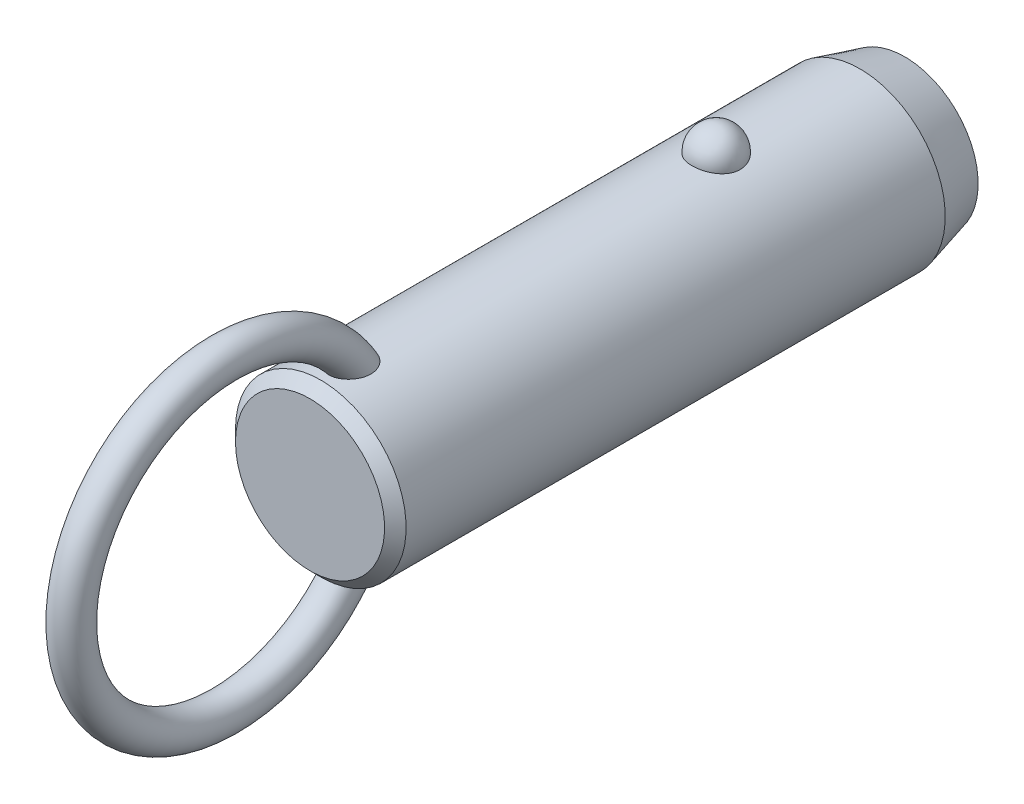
ISO-10303-21;
HEADER;
FILE_DESCRIPTION(('STEP AP214'),'2;1');
FILE_NAME('part.step','',(''),(''),'','','');
FILE_SCHEMA(('AUTOMOTIVE_DESIGN { 1 0 10303 214 1 1 1 1 }'));
ENDSEC;
DATA;
#1=APPLICATION_CONTEXT('core data for automotive mechanical design processes');
#2=APPLICATION_PROTOCOL_DEFINITION('international standard','automotive_design',2000,#1);
#3=PRODUCT_CONTEXT('',#1,'mechanical');
#4=PRODUCT('Part','Part','',(#3));
#5=PRODUCT_RELATED_PRODUCT_CATEGORY('part','',(#4));
#6=PRODUCT_DEFINITION_FORMATION('','',#4);
#7=PRODUCT_DEFINITION_CONTEXT('part definition',#1,'design');
#8=PRODUCT_DEFINITION('design','',#6,#7);
#9=PRODUCT_DEFINITION_SHAPE('','',#8);
#10=(LENGTH_UNIT() NAMED_UNIT(*) SI_UNIT(.MILLI.,.METRE.));
#11=(NAMED_UNIT(*) PLANE_ANGLE_UNIT() SI_UNIT($,.RADIAN.));
#12=(NAMED_UNIT(*) SI_UNIT($,.STERADIAN.) SOLID_ANGLE_UNIT());
#13=UNCERTAINTY_MEASURE_WITH_UNIT(LENGTH_MEASURE(1.E-05),#10,'distance_accuracy_value','');
#14=(GEOMETRIC_REPRESENTATION_CONTEXT(3) GLOBAL_UNCERTAINTY_ASSIGNED_CONTEXT((#13)) GLOBAL_UNIT_ASSIGNED_CONTEXT((#10,
#11,#12)) REPRESENTATION_CONTEXT('',''));
#15=CARTESIAN_POINT('',(0.,0.,0.));
#16=DIRECTION('',(0.,0.,1.));
#17=DIRECTION('',(1.,0.,0.));
#18=AXIS2_PLACEMENT_3D('',#15,#16,#17);
#19=CARTESIAN_POINT('',(0.,0.,33.));
#20=DIRECTION('',(0.,0.,-1.));
#21=DIRECTION('',(-1.,0.,0.));
#22=AXIS2_PLACEMENT_3D('',#19,#20,#21);
#23=CYLINDRICAL_SURFACE('',#22,9.5);
#24=CARTESIAN_POINT('',(2.67259918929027,9.11631578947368,-2.7));
#25=CARTESIAN_POINT('',(2.6725968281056,9.11631786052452,-2.54909854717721));
#26=CARTESIAN_POINT('',(2.66030567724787,9.11994722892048,-2.39816735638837));
#27=CARTESIAN_POINT('',(2.6114347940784,9.13405924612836,-2.10058568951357));
#28=CARTESIAN_POINT('',(2.57484658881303,9.14454428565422,-1.95393672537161));
#29=CARTESIAN_POINT('',(2.47830875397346,9.17117631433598,-1.66916069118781));
#30=CARTESIAN_POINT('',(2.41836936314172,9.18732082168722,-1.53102991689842));
#31=CARTESIAN_POINT('',(2.27661331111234,9.22346780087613,-1.26705393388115));
#32=CARTESIAN_POINT('',(2.19479699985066,9.24347021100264,-1.14120852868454));
#33=CARTESIAN_POINT('',(2.01085282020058,9.28522401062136,-0.904632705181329));
#34=CARTESIAN_POINT('',(1.90862396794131,9.30698376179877,-0.793982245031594));
#35=CARTESIAN_POINT('',(1.6867437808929,9.34973971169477,-0.591607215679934));
#36=CARTESIAN_POINT('',(1.56709244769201,9.37073591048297,-0.499882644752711));
#37=CARTESIAN_POINT('',(1.31393976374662,9.40956370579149,-0.338167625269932));
#38=CARTESIAN_POINT('',(1.18048026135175,9.42740444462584,-0.268113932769));
#39=CARTESIAN_POINT('',(0.903154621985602,9.45799906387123,-0.151390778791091));
#40=CARTESIAN_POINT('',(0.759289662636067,9.47075351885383,-0.104718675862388));
#41=CARTESIAN_POINT('',(0.468074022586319,9.48956256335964,-0.0367633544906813));
#42=CARTESIAN_POINT('',(0.320836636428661,9.49573643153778,-0.0150275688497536));
#43=CARTESIAN_POINT('',(0.0246714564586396,9.50112183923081,0.00396199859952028));
#44=CARTESIAN_POINT('',(-0.124256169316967,9.50033406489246,0.00121819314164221));
#45=CARTESIAN_POINT('',(-0.417264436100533,9.4919475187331,-0.028444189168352));
#46=CARTESIAN_POINT('',(-0.561384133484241,9.48444885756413,-0.0550074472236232));
#47=CARTESIAN_POINT('',(-0.842986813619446,9.46357853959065,-0.131064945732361));
#48=CARTESIAN_POINT('',(-0.98046968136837,9.450206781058,-0.180559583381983));
#49=CARTESIAN_POINT('',(-1.24585005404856,9.41890822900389,-0.301476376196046));
#50=CARTESIAN_POINT('',(-1.37368611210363,9.40095498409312,-0.373026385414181));
#51=CARTESIAN_POINT('',(-1.61552738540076,9.3624296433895,-0.536025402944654));
#52=CARTESIAN_POINT('',(-1.72953116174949,9.34185727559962,-0.627476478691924));
#53=CARTESIAN_POINT('',(-1.9429225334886,9.29984568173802,-0.829844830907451));
#54=CARTESIAN_POINT('',(-2.04198021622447,9.27839736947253,-0.941108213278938));
#55=CARTESIAN_POINT('',(-2.2202646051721,9.23735994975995,-1.17883414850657));
#56=CARTESIAN_POINT('',(-2.29948985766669,9.21777097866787,-1.30529781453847));
#57=CARTESIAN_POINT('',(-2.43697287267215,9.18238994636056,-1.57158566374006));
#58=CARTESIAN_POINT('',(-2.49497068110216,9.16664569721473,-1.71155057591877));
#59=CARTESIAN_POINT('',(-2.5872073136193,9.14104303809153,-1.99961197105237));
#60=CARTESIAN_POINT('',(-2.62144683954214,9.13118445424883,-2.14770821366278));
#61=CARTESIAN_POINT('',(-2.66521466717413,9.11850622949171,-2.44715424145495));
#62=CARTESIAN_POINT('',(-2.67484831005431,9.11565658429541,-2.59848735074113));
#63=CARTESIAN_POINT('',(-2.66946735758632,9.11723375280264,-2.90067317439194));
#64=CARTESIAN_POINT('',(-2.65445345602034,9.12166036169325,-3.05152590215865));
#65=CARTESIAN_POINT('',(-2.6002971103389,9.13724422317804,-3.34766110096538));
#66=CARTESIAN_POINT('',(-2.56127978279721,9.14836656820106,-3.49296833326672));
#67=CARTESIAN_POINT('',(-2.46018844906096,9.17606676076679,-3.77477535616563));
#68=CARTESIAN_POINT('',(-2.39811349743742,9.19264483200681,-3.9112747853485));
#69=CARTESIAN_POINT('',(-2.25202303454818,9.22952198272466,-4.17244273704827));
#70=CARTESIAN_POINT('',(-2.16788714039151,9.24984129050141,-4.29704106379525));
#71=CARTESIAN_POINT('',(-1.9799408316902,9.29188255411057,-4.53013066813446));
#72=CARTESIAN_POINT('',(-1.87612963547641,9.31360456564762,-4.63862130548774));
#73=CARTESIAN_POINT('',(-1.65105429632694,9.35612959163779,-4.8369029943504));
#74=CARTESIAN_POINT('',(-1.52972405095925,9.37692871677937,-4.92661991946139));
#75=CARTESIAN_POINT('',(-1.27318250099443,9.41518970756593,-5.08429106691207));
#76=CARTESIAN_POINT('',(-1.13797219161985,9.432651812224,-5.15224684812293));
#77=CARTESIAN_POINT('',(-0.859280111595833,9.46208255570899,-5.26371827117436));
#78=CARTESIAN_POINT('',(-0.715925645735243,9.47411833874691,-5.30753421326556));
#79=CARTESIAN_POINT('',(-0.423550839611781,9.4916822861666,-5.37076321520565));
#80=CARTESIAN_POINT('',(-0.274531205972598,9.49721125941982,-5.39017930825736));
#81=CARTESIAN_POINT('',(0.0218446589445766,9.50110860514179,-5.40390587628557));
#82=CARTESIAN_POINT('',(0.169177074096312,9.49961381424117,-5.39869609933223));
#83=CARTESIAN_POINT('',(0.460808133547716,9.48993906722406,-5.3644195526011));
#84=CARTESIAN_POINT('',(0.605106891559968,9.48175936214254,-5.33535367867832));
#85=CARTESIAN_POINT('',(0.886027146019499,9.4596376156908,-5.2543558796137));
#86=CARTESIAN_POINT('',(1.02267710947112,9.44571881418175,-5.20251612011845));
#87=CARTESIAN_POINT('',(1.28523827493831,9.41358993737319,-5.07741549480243));
#88=CARTESIAN_POINT('',(1.41114877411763,9.39537958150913,-5.00415322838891));
#89=CARTESIAN_POINT('',(1.65085227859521,9.3562644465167,-4.83684599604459));
#90=CARTESIAN_POINT('',(1.76442346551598,9.33532178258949,-4.74249218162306));
#91=CARTESIAN_POINT('',(1.97425672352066,9.29321198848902,-4.53620389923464));
#92=CARTESIAN_POINT('',(2.07051582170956,9.27204482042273,-4.42426641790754));
#93=CARTESIAN_POINT('',(2.24490086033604,9.23139221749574,-4.18363183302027));
#94=CARTESIAN_POINT('',(2.32267019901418,9.21194380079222,-4.05466990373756));
#95=CARTESIAN_POINT('',(2.45584092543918,9.1773419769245,-3.78517836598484));
#96=CARTESIAN_POINT('',(2.51124979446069,9.16218713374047,-3.64465264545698));
#97=CARTESIAN_POINT('',(2.59380876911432,9.13913522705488,-3.37104301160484));
#98=CARTESIAN_POINT('',(2.62330266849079,9.13064624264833,-3.23871053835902));
#99=CARTESIAN_POINT('',(2.66269870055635,9.11923566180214,-2.97092664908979));
#100=CARTESIAN_POINT('',(2.67260130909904,9.11631393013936,-2.83547530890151));
#101=CARTESIAN_POINT('',(2.67259918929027,9.11631578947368,-2.7));
#102=B_SPLINE_CURVE_WITH_KNOTS('',3,(#24,#25,#26,#27,#28,#29,#30,#31,#32,#33,#34,#35,#36,#37,
#38,#39,#40,#41,#42,#43,#44,#45,#46,#47,#48,#49,#50,#51,#52,#53,#54,#55,#56,#57,#58,#59,#60,#61,
#62,#63,#64,#65,#66,#67,#68,#69,#70,#71,#72,#73,#74,#75,#76,#77,#78,#79,#80,#81,#82,#83,#84,#85,
#86,#87,#88,#89,#90,#91,#92,#93,#94,#95,#96,#97,#98,#99,#100,#101),.UNSPECIFIED.,.T.,.F.,(4,2,2,
2,2,2,2,2,2,2,2,2,2,2,2,2,2,2,2,2,2,2,2,2,2,2,2,2,2,2,2,2,2,2,2,2,2,2,4),(0.,0.452217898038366,
0.904593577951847,1.35677112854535,1.80894144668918,2.26340676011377,2.71787203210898,
3.17099820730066,3.62407318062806,4.0687883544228,4.51345969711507,4.95160616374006,
5.38976021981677,5.83050358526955,6.27129275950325,6.72071308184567,7.17016633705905,
7.62495278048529,8.07972578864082,8.53254856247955,8.98535859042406,9.43582813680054,
9.88631615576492,10.3393155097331,10.7923328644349,11.2471065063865,11.7018475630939,
12.1507959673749,12.5996885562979,13.0398725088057,13.4800399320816,13.9184421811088,
14.3568730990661,14.802202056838,15.2476074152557,15.7010097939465,16.1542603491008,
16.5602594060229,16.9662486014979),.UNSPECIFIED.);
#103=CARTESIAN_POINT('',(2.67259918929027,9.11631578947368,-2.7));
#104=VERTEX_POINT('',#103);
#105=EDGE_CURVE('E41',#104,#104,#102,.T.);
#106=ORIENTED_EDGE('',*,*,#105,.T.);
#107=EDGE_LOOP('',(#106));
#108=FACE_BOUND('',#107,.T.);
#109=CARTESIAN_POINT('',(0.,0.,41.32));
#110=DIRECTION('',(0.,0.,1.));
#111=DIRECTION('',(1.,0.,0.));
#112=AXIS2_PLACEMENT_3D('',#109,#110,#111);
#113=CIRCLE('',#112,9.5);
#114=CARTESIAN_POINT('',(-9.5,0.,41.32));
#115=VERTEX_POINT('',#114);
#116=EDGE_CURVE('E10',#115,#115,#113,.F.);
#117=ORIENTED_EDGE('',*,*,#116,.T.);
#118=EDGE_LOOP('',(#117));
#119=FACE_BOUND('',#118,.T.);
#120=CARTESIAN_POINT('',(-0.697062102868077,-9.47439269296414,35.6678088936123));
#121=CARTESIAN_POINT('',(-0.799579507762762,-9.46685146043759,35.7074823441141));
#122=CARTESIAN_POINT('',(-0.898575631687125,-9.45788043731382,35.7559309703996));
#123=CARTESIAN_POINT('',(-1.08670047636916,-9.43811593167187,35.8688685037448));
#124=CARTESIAN_POINT('',(-1.17583204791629,-9.42732297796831,35.9333527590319));
#125=CARTESIAN_POINT('',(-1.34179806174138,-9.40513672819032,36.0762099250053));
#126=CARTESIAN_POINT('',(-1.41865133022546,-9.39374438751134,36.154561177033));
#127=CARTESIAN_POINT('',(-1.5586004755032,-9.37154196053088,36.3227524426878));
#128=CARTESIAN_POINT('',(-1.62169476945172,-9.3607319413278,36.4125937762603));
#129=CARTESIAN_POINT('',(-1.73527695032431,-9.34035749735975,36.6045001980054));
#130=CARTESIAN_POINT('',(-1.7852226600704,-9.33085270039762,36.7068910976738));
#131=CARTESIAN_POINT('',(-1.86924997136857,-9.3143834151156,36.918148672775));
#132=CARTESIAN_POINT('',(-1.90332570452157,-9.30741986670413,37.0270177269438));
#133=CARTESIAN_POINT('',(-1.95893603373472,-9.29588482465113,37.2604730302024));
#134=CARTESIAN_POINT('',(-1.97872420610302,-9.29165182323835,37.3854890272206));
#135=CARTESIAN_POINT('',(-2.00062129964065,-9.28695978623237,37.6370805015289));
#136=CARTESIAN_POINT('',(-2.00272284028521,-9.28650232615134,37.763656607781));
#137=CARTESIAN_POINT('',(-1.98958876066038,-9.28932750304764,38.0368157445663));
#138=CARTESIAN_POINT('',(-1.97143366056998,-9.2932400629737,38.1832519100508));
#139=CARTESIAN_POINT('',(-1.91479925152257,-9.30507151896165,38.4720629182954));
#140=CARTESIAN_POINT('',(-1.87629122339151,-9.31299607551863,38.614431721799));
#141=CARTESIAN_POINT('',(-1.77225683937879,-9.33340232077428,38.9151725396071));
#142=CARTESIAN_POINT('',(-1.70334898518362,-9.34641636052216,39.0723691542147));
#143=CARTESIAN_POINT('',(-1.58111062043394,-9.36759153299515,39.2975171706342));
#144=CARTESIAN_POINT('',(-1.53721459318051,-9.37492619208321,39.3707968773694));
#145=CARTESIAN_POINT('',(-1.44302631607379,-9.38988566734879,39.5130740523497));
#146=CARTESIAN_POINT('',(-1.39273721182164,-9.39751033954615,39.5820736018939));
#147=CARTESIAN_POINT('',(-1.26775962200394,-9.41530678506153,39.7369832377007));
#148=CARTESIAN_POINT('',(-1.19052326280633,-9.42548108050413,39.8208712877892));
#149=CARTESIAN_POINT('',(-1.02420241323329,-9.44499825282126,39.9760086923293));
#150=CARTESIAN_POINT('',(-0.935139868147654,-9.45434261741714,40.0472808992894));
#151=CARTESIAN_POINT('',(-0.766610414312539,-9.46930670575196,40.1586955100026));
#152=CARTESIAN_POINT('',(-0.689439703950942,-9.47529223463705,40.2022354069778));
#153=CARTESIAN_POINT('',(-0.528942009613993,-9.48560294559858,40.2763133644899));
#154=CARTESIAN_POINT('',(-0.44562029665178,-9.48992953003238,40.3068624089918));
#155=CARTESIAN_POINT('',(-0.273901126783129,-9.49644161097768,40.3525792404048));
#156=CARTESIAN_POINT('',(-0.185465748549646,-9.49860811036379,40.36761059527));
#157=CARTESIAN_POINT('',(-0.00734541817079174,-9.5004135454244,40.3801494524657));
#158=CARTESIAN_POINT('',(0.0823387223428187,-9.50005405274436,40.3776678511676));
#159=CARTESIAN_POINT('',(0.247679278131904,-9.49708301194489,40.3569959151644));
#160=CARTESIAN_POINT('',(0.323620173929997,-9.49477609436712,40.3409300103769));
#161=CARTESIAN_POINT('',(0.471981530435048,-9.48855917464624,40.2971726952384));
#162=CARTESIAN_POINT('',(0.54440029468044,-9.48464840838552,40.2694757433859));
#163=CARTESIAN_POINT('',(0.708947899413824,-9.47398336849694,40.1928026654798));
#164=CARTESIAN_POINT('',(0.799149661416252,-9.46671310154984,40.1397745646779));
#165=CARTESIAN_POINT('',(0.969783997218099,-9.4507622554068,40.0199731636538));
#166=CARTESIAN_POINT('',(1.05019415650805,-9.44207854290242,39.9531692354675));
#167=CARTESIAN_POINT('',(1.23092343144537,-9.42051459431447,39.7807596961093));
#168=CARTESIAN_POINT('',(1.32652499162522,-9.40733378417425,39.6702619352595));
#169=CARTESIAN_POINT('',(1.49893121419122,-9.38140745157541,39.4355614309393));
#170=CARTESIAN_POINT('',(1.57571616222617,-9.36866239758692,39.3113445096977));
#171=CARTESIAN_POINT('',(1.71285426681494,-9.34457644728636,39.0493891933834));
#172=CARTESIAN_POINT('',(1.77266365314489,-9.33328726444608,38.9113623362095));
#173=CARTESIAN_POINT('',(1.87239208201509,-9.31379209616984,38.6280515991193));
#174=CARTESIAN_POINT('',(1.91230158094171,-9.3055875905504,38.482764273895));
#175=CARTESIAN_POINT('',(1.9760418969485,-9.29228394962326,38.1620281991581));
#176=CARTESIAN_POINT('',(1.99587438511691,-9.28797202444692,37.9857248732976));
#177=CARTESIAN_POINT('',(2.0029570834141,-9.28645519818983,37.6324146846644));
#178=CARTESIAN_POINT('',(1.99025930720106,-9.28923895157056,37.4554093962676));
#179=CARTESIAN_POINT('',(1.93735479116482,-9.30038134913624,37.1563381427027));
#180=CARTESIAN_POINT('',(1.90576827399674,-9.30697680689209,37.0326679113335));
#181=CARTESIAN_POINT('',(1.82287484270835,-9.32356855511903,36.7923297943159));
#182=CARTESIAN_POINT('',(1.77158213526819,-9.33356239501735,36.6756569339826));
#183=CARTESIAN_POINT('',(1.64885744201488,-9.35602275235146,36.4527061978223));
#184=CARTESIAN_POINT('',(1.57730995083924,-9.36850332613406,36.3464927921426));
#185=CARTESIAN_POINT('',(1.41543264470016,-9.39431873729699,36.1495530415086));
#186=CARTESIAN_POINT('',(1.32510883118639,-9.40765330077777,36.0588217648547));
#187=CARTESIAN_POINT('',(1.13846223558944,-9.43195720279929,35.9050334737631));
#188=CARTESIAN_POINT('',(1.04369890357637,-9.44302894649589,35.8400947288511));
#189=CARTESIAN_POINT('',(0.843965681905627,-9.46296805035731,35.7280388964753));
#190=CARTESIAN_POINT('',(0.739000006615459,-9.4718363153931,35.6809144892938));
#191=CARTESIAN_POINT('',(0.528175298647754,-9.48586140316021,35.6081173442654));
#192=CARTESIAN_POINT('',(0.422686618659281,-9.49119633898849,35.5814024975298));
#193=CARTESIAN_POINT('',(0.208590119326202,-9.49831365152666,35.5460137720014));
#194=CARTESIAN_POINT('',(0.0999817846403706,-9.500095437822,35.5373428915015));
#195=CARTESIAN_POINT('',(-0.126104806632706,-9.49988861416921,35.5383501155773));
#196=CARTESIAN_POINT('',(-0.243578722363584,-9.49757821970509,35.5495942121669));
#197=CARTESIAN_POINT('',(-0.474390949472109,-9.48885165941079,35.593167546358));
#198=CARTESIAN_POINT('',(-0.587729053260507,-9.48243528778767,35.6254978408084));
#199=CARTESIAN_POINT('',(-0.697062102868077,-9.47439269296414,35.6678088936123));
#200=B_SPLINE_CURVE_WITH_KNOTS('',3,(#120,#121,#122,#123,#124,#125,#126,#127,#128,#129,#130,
#131,#132,#133,#134,#135,#136,#137,#138,#139,#140,#141,#142,#143,#144,#145,#146,#147,#148,#149,
#150,#151,#152,#153,#154,#155,#156,#157,#158,#159,#160,#161,#162,#163,#164,#165,#166,#167,#168,
#169,#170,#171,#172,#173,#174,#175,#176,#177,#178,#179,#180,#181,#182,#183,#184,#185,#186,#187,
#188,#189,#190,#191,#192,#193,#194,#195,#196,#197,#198,#199),.UNSPECIFIED.,.T.,.F.,(4,2,2,2,2,2,
2,2,2,2,2,2,2,2,2,2,2,2,2,2,2,2,2,2,2,2,2,2,2,2,2,2,2,2,2,2,2,2,2,4),(0.,0.330119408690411,
0.660143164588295,0.989655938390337,1.31920659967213,1.66074728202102,2.00241415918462,
2.38088696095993,2.75951768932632,3.20065679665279,3.6424200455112,4.15620996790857,
4.41314162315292,4.66994734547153,5.01228664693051,5.35399933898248,5.61943037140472,
5.88463652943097,6.15215502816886,6.41950709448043,6.65144391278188,6.88349136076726,
7.19641200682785,7.51003602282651,7.94779711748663,8.38601491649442,8.83699707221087,
9.28819530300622,9.81778662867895,10.3465317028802,10.7284172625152,11.1100280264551,
11.4938603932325,11.8775702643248,12.2220189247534,12.5663259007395,12.8915939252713,
13.2169159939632,13.5689650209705,13.9210316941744),.UNSPECIFIED.);
#201=CARTESIAN_POINT('',(-0.697062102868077,-9.47439269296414,35.6678088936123));
#202=VERTEX_POINT('',#201);
#203=EDGE_CURVE('E59',#202,#202,#200,.T.);
#204=ORIENTED_EDGE('',*,*,#203,.T.);
#205=EDGE_LOOP('',(#204));
#206=FACE_BOUND('',#205,.T.);
#207=CARTESIAN_POINT('',(-0.697062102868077,9.47439269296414,35.6678088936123));
#208=CARTESIAN_POINT('',(-0.597792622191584,9.48169483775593,35.6293956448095));
#209=CARTESIAN_POINT('',(-0.495106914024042,9.48766580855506,35.5991682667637));
#210=CARTESIAN_POINT('',(-0.285876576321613,9.49627648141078,35.5560327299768));
#211=CARTESIAN_POINT('',(-0.179324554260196,9.49890941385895,35.5431597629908));
#212=CARTESIAN_POINT('',(0.0344157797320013,9.50053798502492,35.5351666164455));
#213=CARTESIAN_POINT('',(0.141603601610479,9.49953613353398,35.5400341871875));
#214=CARTESIAN_POINT('',(0.353563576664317,9.49401038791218,35.5673654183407));
#215=CARTESIAN_POINT('',(0.458336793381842,9.48948807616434,35.58982117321));
#216=CARTESIAN_POINT('',(0.66249373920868,9.4774236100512,35.6516719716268));
#217=CARTESIAN_POINT('',(0.761881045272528,9.46988348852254,35.6910556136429));
#218=CARTESIAN_POINT('',(0.952608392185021,9.45260382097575,35.7856342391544));
#219=CARTESIAN_POINT('',(1.04394806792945,9.44286417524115,35.8408299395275));
#220=CARTESIAN_POINT('',(1.21712767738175,9.4221176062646,35.9660662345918));
#221=CARTESIAN_POINT('',(1.29885671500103,9.41109835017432,36.0362579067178));
#222=CARTESIAN_POINT('',(1.4497897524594,9.38903310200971,36.188980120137));
#223=CARTESIAN_POINT('',(1.51899278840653,9.37798710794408,36.2715116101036));
#224=CARTESIAN_POINT('',(1.64602857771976,9.35654375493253,36.4497763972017));
#225=CARTESIAN_POINT('',(1.70333052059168,9.34618688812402,36.5458916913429));
#226=CARTESIAN_POINT('',(1.80259341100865,9.32755128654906,36.745897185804));
#227=CARTESIAN_POINT('',(1.84454942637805,9.31927322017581,36.8497898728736));
#228=CARTESIAN_POINT('',(1.91637039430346,9.30478365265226,37.072213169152));
#229=CARTESIAN_POINT('',(1.944805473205,9.29882552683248,37.1912192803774));
#230=CARTESIAN_POINT('',(1.98449865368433,9.29043398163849,37.4321436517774));
#231=CARTESIAN_POINT('',(1.99574908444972,9.28800213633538,37.5540631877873));
#232=CARTESIAN_POINT('',(2.00275141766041,9.28649645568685,37.8169324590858));
#233=CARTESIAN_POINT('',(1.99588238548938,9.28799035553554,37.9579529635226));
#234=CARTESIAN_POINT('',(1.96270559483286,9.29505517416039,38.2376217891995));
#235=CARTESIAN_POINT('',(1.93637872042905,9.30063010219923,38.376267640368));
#236=CARTESIAN_POINT('',(1.85949176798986,9.31633564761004,38.6725616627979));
#237=CARTESIAN_POINT('',(1.80549792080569,9.3270926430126,38.8292907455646));
#238=CARTESIAN_POINT('',(1.67376869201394,9.3516306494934,39.1322840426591));
#239=CARTESIAN_POINT('',(1.59603181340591,9.36541185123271,39.2785475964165));
#240=CARTESIAN_POINT('',(1.4360277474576,9.39110706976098,39.5258138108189));
#241=CARTESIAN_POINT('',(1.35831795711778,9.40278656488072,39.629791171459));
#242=CARTESIAN_POINT('',(1.18774483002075,9.42585025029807,39.8245347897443));
#243=CARTESIAN_POINT('',(1.09490932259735,9.43723493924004,39.9153247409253));
#244=CARTESIAN_POINT('',(0.921110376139,9.45552616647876,40.0562033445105));
#245=CARTESIAN_POINT('',(0.843738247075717,9.46281058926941,40.1106563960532));
#246=CARTESIAN_POINT('',(0.681245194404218,9.47589120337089,40.2067117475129));
#247=CARTESIAN_POINT('',(0.596135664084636,9.48168953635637,40.2483325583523));
#248=CARTESIAN_POINT('',(0.433779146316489,9.49038144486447,40.3100899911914));
#249=CARTESIAN_POINT('',(0.357459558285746,9.49359170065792,40.3326013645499));
#250=CARTESIAN_POINT('',(0.20207411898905,9.49816761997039,40.3645745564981));
#251=CARTESIAN_POINT('',(0.12301025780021,9.49953459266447,40.3740456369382));
#252=CARTESIAN_POINT('',(-0.0357372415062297,9.50026497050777,40.3791143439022));
#253=CARTESIAN_POINT('',(-0.115421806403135,9.49962433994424,40.3746840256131));
#254=CARTESIAN_POINT('',(-0.272823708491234,9.49640854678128,40.3522962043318));
#255=CARTESIAN_POINT('',(-0.350540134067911,9.4938325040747,40.3343325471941));
#256=CARTESIAN_POINT('',(-0.500580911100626,9.4870946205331,40.2868028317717));
#257=CARTESIAN_POINT('',(-0.572979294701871,9.48296359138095,40.2574618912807));
#258=CARTESIAN_POINT('',(-0.712864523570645,9.47347609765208,40.1890087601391));
#259=CARTESIAN_POINT('',(-0.7803490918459,9.46811906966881,40.1498920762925));
#260=CARTESIAN_POINT('',(-0.946309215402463,9.45329720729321,40.039432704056));
#261=CARTESIAN_POINT('',(-1.04090230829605,9.44321512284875,39.9623297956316));
#262=CARTESIAN_POINT('',(-1.21661929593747,9.42219227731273,39.7940971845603));
#263=CARTESIAN_POINT('',(-1.29770519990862,9.41124921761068,39.7029292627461));
#264=CARTESIAN_POINT('',(-1.4731964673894,9.38563439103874,39.4761621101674));
#265=CARTESIAN_POINT('',(-1.56208878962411,9.37102009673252,39.3362895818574));
#266=CARTESIAN_POINT('',(-1.71623987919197,9.34401559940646,39.0439503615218));
#267=CARTESIAN_POINT('',(-1.7814786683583,9.33162728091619,38.8914731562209));
#268=CARTESIAN_POINT('',(-1.88853837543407,9.31055541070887,38.5756470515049));
#269=CARTESIAN_POINT('',(-1.9299899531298,9.30193076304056,38.4121685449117));
#270=CARTESIAN_POINT('',(-1.98590726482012,9.29015757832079,38.0805268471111));
#271=CARTESIAN_POINT('',(-2.00040705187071,9.2870021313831,37.9123698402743));
#272=CARTESIAN_POINT('',(-1.99964701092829,9.28716218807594,37.6050806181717));
#273=CARTESIAN_POINT('',(-1.98908145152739,9.28945704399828,37.4659362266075));
#274=CARTESIAN_POINT('',(-1.94566294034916,9.29865169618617,37.1911539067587));
#275=CARTESIAN_POINT('',(-1.91282062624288,9.30554929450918,37.055514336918));
#276=CARTESIAN_POINT('',(-1.84582133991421,9.31898248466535,36.8578026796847));
#277=CARTESIAN_POINT('',(-1.82038084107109,9.32400364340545,36.7925830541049));
#278=CARTESIAN_POINT('',(-1.76350511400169,9.33492884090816,36.6649033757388));
#279=CARTESIAN_POINT('',(-1.73207305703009,9.3408324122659,36.6024418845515));
#280=CARTESIAN_POINT('',(-1.66324243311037,9.353333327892,36.4809407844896));
#281=CARTESIAN_POINT('',(-1.62584239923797,9.35993084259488,36.4219020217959));
#282=CARTESIAN_POINT('',(-1.545276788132,9.37356864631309,36.3079875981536));
#283=CARTESIAN_POINT('',(-1.50211241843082,9.38060884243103,36.2531110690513));
#284=CARTESIAN_POINT('',(-1.37681147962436,9.40004442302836,36.1099619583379));
#285=CARTESIAN_POINT('',(-1.28916358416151,9.41261047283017,36.0264295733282));
#286=CARTESIAN_POINT('',(-1.09996826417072,9.43658180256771,35.8772360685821));
#287=CARTESIAN_POINT('',(-0.998461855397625,9.44799034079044,35.8115238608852));
#288=CARTESIAN_POINT('',(-0.860188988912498,9.46103017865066,35.7394367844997));
#289=CARTESIAN_POINT('',(-0.82814120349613,9.46389141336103,35.7238511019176));
#290=CARTESIAN_POINT('',(-0.763210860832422,9.46934915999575,35.6944734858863));
#291=CARTESIAN_POINT('',(-0.730328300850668,9.47194567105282,35.6806815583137));
#292=CARTESIAN_POINT('',(-0.697062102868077,9.47439269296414,35.6678088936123));
#293=B_SPLINE_CURVE_WITH_KNOTS('',3,(#207,#208,#209,#210,#211,#212,#213,#214,#215,#216,#217,
#218,#219,#220,#221,#222,#223,#224,#225,#226,#227,#228,#229,#230,#231,#232,#233,#234,#235,#236,
#237,#238,#239,#240,#241,#242,#243,#244,#245,#246,#247,#248,#249,#250,#251,#252,#253,#254,#255,
#256,#257,#258,#259,#260,#261,#262,#263,#264,#265,#266,#267,#268,#269,#270,#271,#272,#273,#274,
#275,#276,#277,#278,#279,#280,#281,#282,#283,#284,#285,#286,#287,#288,#289,#290,#291,#292),
.UNSPECIFIED.,.T.,.F.,(4,2,2,2,2,2,2,2,2,2,2,2,2,2,2,2,2,2,2,2,2,2,2,2,2,2,2,2,2,2,2,2,2,2,2,2,
2,2,2,2,2,2,4),(0.,0.319942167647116,0.640532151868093,0.96090081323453,1.28112555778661,
1.60113495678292,1.92115886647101,2.24457323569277,2.56801248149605,2.90371927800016,
3.23953387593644,3.60560313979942,3.97183576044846,4.39383693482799,4.81625324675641,
5.31257045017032,5.80891895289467,6.19868344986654,6.58773876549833,6.87145417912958,
7.15475838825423,7.3926375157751,7.63034760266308,7.86853584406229,8.10683246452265,
8.3406366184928,8.57454843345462,8.93983939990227,9.30614105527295,9.80266668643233,
10.2996107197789,10.8040753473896,11.3079021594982,11.7249776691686,12.1418541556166,
12.3521485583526,12.562331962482,12.7725671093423,12.9827582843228,13.3458276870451,
13.7078449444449,13.8150604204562,13.9222762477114),.UNSPECIFIED.);
#294=CARTESIAN_POINT('',(-0.697062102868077,9.47439269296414,35.6678088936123));
#295=VERTEX_POINT('',#294);
#296=EDGE_CURVE('E67',#295,#295,#293,.T.);
#297=ORIENTED_EDGE('',*,*,#296,.T.);
#298=EDGE_LOOP('',(#297));
#299=FACE_BOUND('',#298,.T.);
#300=CARTESIAN_POINT('',(0.,0.,-18.6999999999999));
#301=DIRECTION('',(0.,0.,-1.));
#302=DIRECTION('',(-1.,0.,0.));
#303=AXIS2_PLACEMENT_3D('',#300,#301,#302);
#304=CIRCLE('',#303,9.5);
#305=CARTESIAN_POINT('',(-9.5,0.,-18.6999999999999));
#306=VERTEX_POINT('',#305);
#307=EDGE_CURVE('E56',#306,#306,#304,.F.);
#308=ORIENTED_EDGE('',*,*,#307,.T.);
#309=EDGE_LOOP('',(#308));
#310=FACE_BOUND('',#309,.T.);
#311=ADVANCED_FACE('F37',(#108,#119,#206,#299,#310),#23,.T.);
#312=CARTESIAN_POINT('',(0.,0.,-23.7));
#313=DIRECTION('',(0.,0.,-1.));
#314=DIRECTION('',(-1.,0.,0.));
#315=AXIS2_PLACEMENT_3D('',#312,#313,#314);
#316=PLANE('',#315);
#317=CARTESIAN_POINT('',(0.,0.,-23.7));
#318=DIRECTION('',(0.,0.,-1.));
#319=DIRECTION('',(-1.,0.,0.));
#320=AXIS2_PLACEMENT_3D('',#317,#318,#319);
#321=CIRCLE('',#320,8.16025403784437);
#322=CARTESIAN_POINT('',(-8.16025403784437,0.,-23.7));
#323=VERTEX_POINT('',#322);
#324=EDGE_CURVE('E66',#323,#323,#321,.T.);
#325=ORIENTED_EDGE('',*,*,#324,.T.);
#326=EDGE_LOOP('',(#325));
#327=FACE_BOUND('',#326,.T.);
#328=ADVANCED_FACE('F85',(#327),#316,.T.);
#329=CARTESIAN_POINT('',(0.,0.,-23.7));
#330=DIRECTION('',(0.,0.,1.));
#331=DIRECTION('',(1.,0.,0.));
#332=AXIS2_PLACEMENT_3D('',#329,#330,#331);
#333=CONICAL_SURFACE('',#332,8.16025403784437,0.261799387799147);
#334=ORIENTED_EDGE('',*,*,#307,.F.);
#335=EDGE_LOOP('',(#334));
#336=FACE_BOUND('',#335,.T.);
#337=ORIENTED_EDGE('',*,*,#324,.F.);
#338=EDGE_LOOP('',(#337));
#339=FACE_BOUND('',#338,.T.);
#340=ADVANCED_FACE('F83',(#336,#339),#333,.T.);
#341=CARTESIAN_POINT('',(0.,0.,42.52));
#342=DIRECTION('',(0.,0.,1.));
#343=DIRECTION('',(1.,0.,0.));
#344=AXIS2_PLACEMENT_3D('',#341,#342,#343);
#345=PLANE('',#344);
#346=CARTESIAN_POINT('',(0.,0.,42.52));
#347=DIRECTION('',(0.,0.,1.));
#348=DIRECTION('',(1.,0.,0.));
#349=AXIS2_PLACEMENT_3D('',#346,#347,#348);
#350=CIRCLE('',#349,8.29999999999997);
#351=CARTESIAN_POINT('',(-8.29999999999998,0.,42.52));
#352=VERTEX_POINT('',#351);
#353=EDGE_CURVE('E50',#352,#352,#350,.T.);
#354=ORIENTED_EDGE('',*,*,#353,.T.);
#355=EDGE_LOOP('',(#354));
#356=FACE_BOUND('',#355,.T.);
#357=ADVANCED_FACE('F77',(#356),#345,.T.);
#358=CARTESIAN_POINT('',(0.,0.,52.05));
#359=DIRECTION('',(1.,0.,0.));
#360=DIRECTION('',(0.,0.,-1.));
#361=AXIS2_PLACEMENT_3D('',#358,#359,#360);
#362=TOROIDAL_SURFACE('',#361,17.05,2.);
#363=ORIENTED_EDGE('',*,*,#296,.F.);
#364=EDGE_LOOP('',(#363));
#365=FACE_BOUND('',#364,.T.);
#366=ORIENTED_EDGE('',*,*,#203,.F.);
#367=EDGE_LOOP('',(#366));
#368=FACE_BOUND('',#367,.T.);
#369=ADVANCED_FACE('F73',(#365,#368),#362,.T.);
#370=CARTESIAN_POINT('',(0.,0.,42.52));
#371=DIRECTION('',(0.,0.,-1.));
#372=DIRECTION('',(-1.,0.,0.));
#373=AXIS2_PLACEMENT_3D('',#370,#371,#372);
#374=CONICAL_SURFACE('',#373,8.29999999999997,0.78539816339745);
#375=CARTESIAN_POINT('',(-9.5,0.,41.32));
#376=CARTESIAN_POINT('',(-9.4875,0.,41.3325));
#377=CARTESIAN_POINT('',(-9.475,0.,41.345));
#378=CARTESIAN_POINT('',(-9.45,0.,41.37));
#379=CARTESIAN_POINT('',(-9.4375,0.,41.3825));
#380=CARTESIAN_POINT('',(-9.4125,0.,41.4075));
#381=CARTESIAN_POINT('',(-9.4,0.,41.42));
#382=CARTESIAN_POINT('',(-9.375,0.,41.445));
#383=CARTESIAN_POINT('',(-9.3625,0.,41.4575));
#384=CARTESIAN_POINT('',(-9.3375,0.,41.4825));
#385=CARTESIAN_POINT('',(-9.325,0.,41.495));
#386=CARTESIAN_POINT('',(-9.3,0.,41.52));
#387=CARTESIAN_POINT('',(-9.2875,0.,41.5325));
#388=CARTESIAN_POINT('',(-9.2625,0.,41.5575));
#389=CARTESIAN_POINT('',(-9.25,0.,41.57));
#390=CARTESIAN_POINT('',(-9.225,0.,41.595));
#391=CARTESIAN_POINT('',(-9.2125,0.,41.6075));
#392=CARTESIAN_POINT('',(-9.1875,0.,41.6325));
#393=CARTESIAN_POINT('',(-9.175,0.,41.645));
#394=CARTESIAN_POINT('',(-9.15,0.,41.67));
#395=CARTESIAN_POINT('',(-9.1375,0.,41.6825));
#396=CARTESIAN_POINT('',(-9.1125,0.,41.7075));
#397=CARTESIAN_POINT('',(-9.1,0.,41.72));
#398=CARTESIAN_POINT('',(-9.07499999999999,0.,41.745));
#399=CARTESIAN_POINT('',(-9.06249999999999,0.,41.7575));
#400=CARTESIAN_POINT('',(-9.03749999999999,0.,41.7825));
#401=CARTESIAN_POINT('',(-9.02499999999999,0.,41.795));
#402=CARTESIAN_POINT('',(-8.99999999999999,0.,41.82));
#403=CARTESIAN_POINT('',(-8.98749999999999,0.,41.8325));
#404=CARTESIAN_POINT('',(-8.96249999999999,0.,41.8575));
#405=CARTESIAN_POINT('',(-8.94999999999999,0.,41.87));
#406=CARTESIAN_POINT('',(-8.92499999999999,0.,41.895));
#407=CARTESIAN_POINT('',(-8.91249999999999,0.,41.9075));
#408=CARTESIAN_POINT('',(-8.88749999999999,0.,41.9325));
#409=CARTESIAN_POINT('',(-8.87499999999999,0.,41.945));
#410=CARTESIAN_POINT('',(-8.84999999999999,0.,41.97));
#411=CARTESIAN_POINT('',(-8.83749999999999,0.,41.9825));
#412=CARTESIAN_POINT('',(-8.81249999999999,0.,42.0075));
#413=CARTESIAN_POINT('',(-8.79999999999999,0.,42.02));
#414=CARTESIAN_POINT('',(-8.77499999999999,0.,42.045));
#415=CARTESIAN_POINT('',(-8.76249999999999,0.,42.0575));
#416=CARTESIAN_POINT('',(-8.73749999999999,0.,42.0825));
#417=CARTESIAN_POINT('',(-8.72499999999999,0.,42.095));
#418=CARTESIAN_POINT('',(-8.69999999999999,0.,42.12));
#419=CARTESIAN_POINT('',(-8.68749999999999,0.,42.1325));
#420=CARTESIAN_POINT('',(-8.66249999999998,0.,42.1575));
#421=CARTESIAN_POINT('',(-8.64999999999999,0.,42.17));
#422=CARTESIAN_POINT('',(-8.62499999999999,0.,42.195));
#423=CARTESIAN_POINT('',(-8.61249999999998,0.,42.2075));
#424=CARTESIAN_POINT('',(-8.58749999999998,0.,42.2325));
#425=CARTESIAN_POINT('',(-8.57499999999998,0.,42.245));
#426=CARTESIAN_POINT('',(-8.54999999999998,0.,42.27));
#427=CARTESIAN_POINT('',(-8.53749999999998,0.,42.2825));
#428=CARTESIAN_POINT('',(-8.51249999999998,0.,42.3075));
#429=CARTESIAN_POINT('',(-8.49999999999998,0.,42.32));
#430=CARTESIAN_POINT('',(-8.47499999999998,0.,42.345));
#431=CARTESIAN_POINT('',(-8.46249999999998,0.,42.3575));
#432=CARTESIAN_POINT('',(-8.43749999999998,0.,42.3825));
#433=CARTESIAN_POINT('',(-8.42499999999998,0.,42.395));
#434=CARTESIAN_POINT('',(-8.39999999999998,0.,42.42));
#435=CARTESIAN_POINT('',(-8.38749999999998,0.,42.4325));
#436=CARTESIAN_POINT('',(-8.36249999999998,0.,42.4575));
#437=CARTESIAN_POINT('',(-8.34999999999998,0.,42.47));
#438=CARTESIAN_POINT('',(-8.32499999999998,0.,42.495));
#439=CARTESIAN_POINT('',(-8.31249999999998,0.,42.5075));
#440=CARTESIAN_POINT('',(-8.29999999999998,0.,42.52));
#441=B_SPLINE_CURVE_WITH_KNOTS('',3,(#375,#376,#377,#378,#379,#380,#381,#382,#383,#384,#385,
#386,#387,#388,#389,#390,#391,#392,#393,#394,#395,#396,#397,#398,#399,#400,#401,#402,#403,#404,
#405,#406,#407,#408,#409,#410,#411,#412,#413,#414,#415,#416,#417,#418,#419,#420,#421,#422,#423,
#424,#425,#426,#427,#428,#429,#430,#431,#432,#433,#434,#435,#436,#437,#438,#439,#440),
.UNSPECIFIED.,.F.,.F.,(4,2,2,2,2,2,2,2,2,2,2,2,2,2,2,2,2,2,2,2,2,2,2,2,2,2,2,2,2,2,2,2,4),(0.,
0.0530330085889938,0.106066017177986,0.15909902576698,0.212132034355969,0.265165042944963,
0.318198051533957,0.371231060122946,0.424264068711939,0.477297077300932,0.530330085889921,
0.583363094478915,0.636396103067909,0.689429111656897,0.742462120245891,0.795495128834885,
0.848528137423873,0.901561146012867,0.95459415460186,1.00762716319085,1.06066017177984,
1.11369318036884,1.16672618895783,1.21975919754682,1.27279220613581,1.32582521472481,
1.37885822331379,1.43189123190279,1.48492424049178,1.53795724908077,1.59099025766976,
1.64402326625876,1.69705627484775),.UNSPECIFIED.);
#442=EDGE_CURVE('BSEAM39',#115,#352,#441,.T.);
#443=ORIENTED_EDGE('',*,*,#116,.F.);
#444=ORIENTED_EDGE('',*,*,#353,.F.);
#445=ORIENTED_EDGE('',*,*,#442,.T.);
#446=ORIENTED_EDGE('',*,*,#442,.F.);
#447=EDGE_LOOP('',(#443,#445,#444,#446));
#448=FACE_BOUND('',#447,.T.);
#449=ADVANCED_FACE('F39',(#448),#374,.T.);
#450=CARTESIAN_POINT('',(0.,9.5,-2.7));
#451=DIRECTION('',(0.,1.,0.));
#452=DIRECTION('',(0.,0.,-1.));
#453=AXIS2_PLACEMENT_3D('',#450,#451,#452);
#454=SPHERICAL_SURFACE('',#453,2.7);
#455=ORIENTED_EDGE('',*,*,#105,.F.);
#456=EDGE_LOOP('',(#455));
#457=FACE_BOUND('',#456,.T.);
#458=ADVANCED_FACE('F79',(#457),#454,.T.);
#459=CLOSED_SHELL('',(#311,#328,#340,#357,#369,#449,#458));
#460=MANIFOLD_SOLID_BREP('B2',#459);
#461=ADVANCED_BREP_SHAPE_REPRESENTATION('',(#18,#460),#14);
#462=SHAPE_DEFINITION_REPRESENTATION(#9,#461);
ENDSEC;
END-ISO-10303-21;
